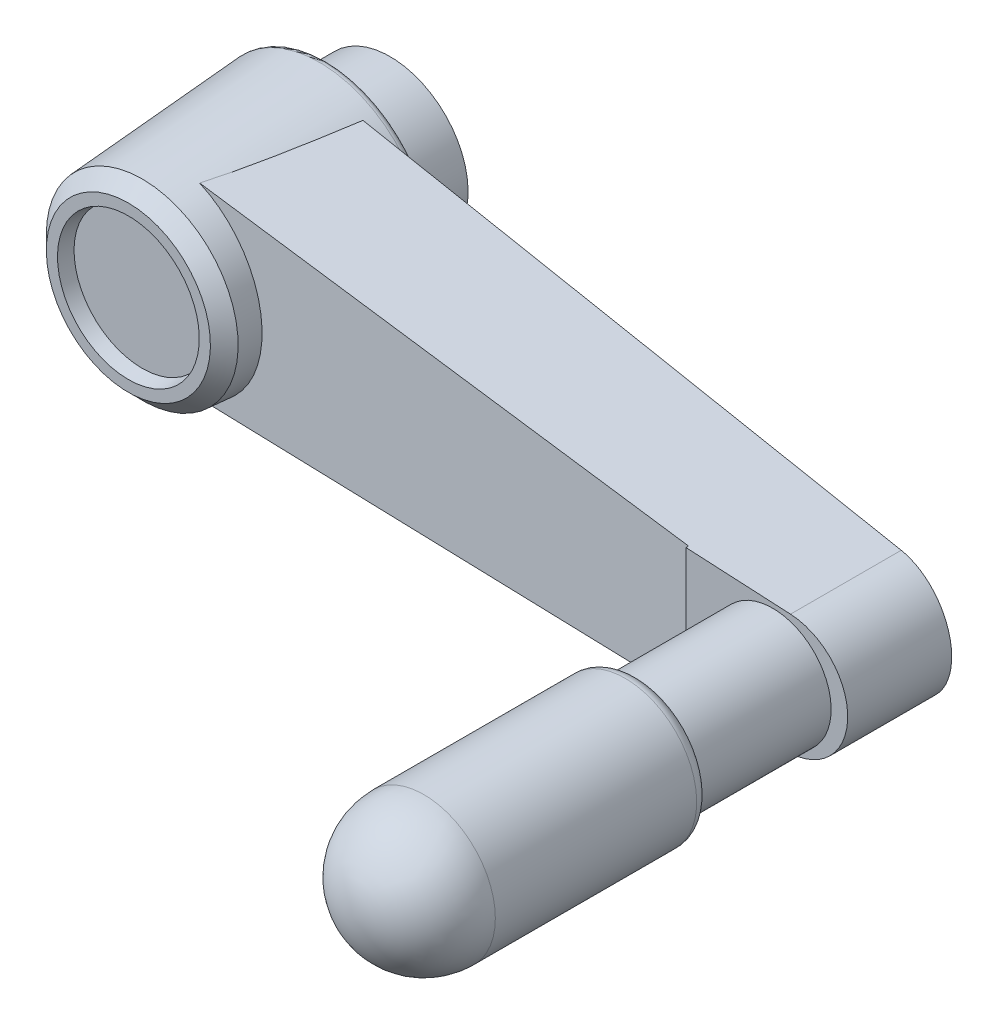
ISO-10303-21;
HEADER;
FILE_DESCRIPTION(('STEP AP214'),'2;1');
FILE_NAME('part.step','',(''),(''),'','','');
FILE_SCHEMA(('AUTOMOTIVE_DESIGN { 1 0 10303 214 1 1 1 1 }'));
ENDSEC;
DATA;
#1=APPLICATION_CONTEXT('core data for automotive mechanical design processes');
#2=APPLICATION_PROTOCOL_DEFINITION('international standard','automotive_design',2000,#1);
#3=PRODUCT_CONTEXT('',#1,'mechanical');
#4=PRODUCT('Part','Part','',(#3));
#5=PRODUCT_RELATED_PRODUCT_CATEGORY('part','',(#4));
#6=PRODUCT_DEFINITION_FORMATION('','',#4);
#7=PRODUCT_DEFINITION_CONTEXT('part definition',#1,'design');
#8=PRODUCT_DEFINITION('design','',#6,#7);
#9=PRODUCT_DEFINITION_SHAPE('','',#8);
#10=(LENGTH_UNIT() NAMED_UNIT(*) SI_UNIT(.MILLI.,.METRE.));
#11=(NAMED_UNIT(*) PLANE_ANGLE_UNIT() SI_UNIT($,.RADIAN.));
#12=(NAMED_UNIT(*) SI_UNIT($,.STERADIAN.) SOLID_ANGLE_UNIT());
#13=UNCERTAINTY_MEASURE_WITH_UNIT(LENGTH_MEASURE(1.E-05),#10,'distance_accuracy_value','');
#14=(GEOMETRIC_REPRESENTATION_CONTEXT(3) GLOBAL_UNCERTAINTY_ASSIGNED_CONTEXT((#13)) GLOBAL_UNIT_ASSIGNED_CONTEXT((#10,
#11,#12)) REPRESENTATION_CONTEXT('',''));
#15=CARTESIAN_POINT('',(0.,0.,0.));
#16=DIRECTION('',(0.,0.,1.));
#17=DIRECTION('',(1.,0.,0.));
#18=AXIS2_PLACEMENT_3D('',#15,#16,#17);
#19=CARTESIAN_POINT('',(0.,0.,24.0000000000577));
#20=DIRECTION('',(0.,0.,-1.));
#21=DIRECTION('',(0.,1.,0.));
#22=AXIS2_PLACEMENT_3D('',#19,#20,#21);
#23=CONICAL_SURFACE('',#22,5.99999999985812,1.04719755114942);
#24=CARTESIAN_POINT('',(2.55795384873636E-10,0.,27.4641016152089));
#25=VERTEX_POINT('',#24);
#26=VERTEX_LOOP('',#25);
#27=FACE_BOUND('',#26,.T.);
#28=CARTESIAN_POINT('',(0.,0.,24.));
#29=DIRECTION('',(0.,0.,-1.));
#30=DIRECTION('',(0.,1.,0.));
#31=AXIS2_PLACEMENT_3D('',#28,#29,#30);
#32=CIRCLE('',#31,6.);
#33=CARTESIAN_POINT('',(0.,6.,24.));
#34=VERTEX_POINT('',#33);
#35=EDGE_CURVE('E296',#34,#34,#32,.T.);
#36=ORIENTED_EDGE('',*,*,#35,.T.);
#37=EDGE_LOOP('',(#36));
#38=FACE_BOUND('',#37,.T.);
#39=ADVANCED_FACE('F15',(#27,#38),#23,.F.);
#40=CARTESIAN_POINT('',(0.,0.,12.41875));
#41=DIRECTION('',(0.,0.,-1.));
#42=DIRECTION('',(0.,1.,0.));
#43=AXIS2_PLACEMENT_3D('',#40,#41,#42);
#44=CYLINDRICAL_SURFACE('',#43,6.);
#45=CARTESIAN_POINT('',(0.,0.,0.837499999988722));
#46=DIRECTION('',(0.,0.,-1.));
#47=DIRECTION('',(1.,0.,0.));
#48=AXIS2_PLACEMENT_3D('',#45,#46,#47);
#49=CIRCLE('',#48,6.00000000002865);
#50=CARTESIAN_POINT('',(6.00000000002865,0.,0.837499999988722));
#51=VERTEX_POINT('',#50);
#52=EDGE_CURVE('E287',#51,#51,#49,.T.);
#53=ORIENTED_EDGE('',*,*,#52,.T.);
#54=EDGE_LOOP('',(#53));
#55=FACE_BOUND('',#54,.T.);
#56=ORIENTED_EDGE('',*,*,#35,.F.);
#57=EDGE_LOOP('',(#56));
#58=FACE_BOUND('',#57,.T.);
#59=ADVANCED_FACE('F397',(#55,#58),#44,.F.);
#60=CARTESIAN_POINT('',(0.,0.,0.));
#61=DIRECTION('',(0.,0.,-1.));
#62=DIRECTION('',(0.,1.,0.));
#63=AXIS2_PLACEMENT_3D('',#60,#61,#62);
#64=CONICAL_SURFACE('',#63,6.83750000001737,0.785398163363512);
#65=CARTESIAN_POINT('',(0.,0.,0.));
#66=DIRECTION('',(0.,0.,-1.));
#67=DIRECTION('',(0.,1.,0.));
#68=AXIS2_PLACEMENT_3D('',#65,#66,#67);
#69=CIRCLE('',#68,6.83750000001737);
#70=CARTESIAN_POINT('',(0.,6.83750000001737,0.));
#71=VERTEX_POINT('',#70);
#72=EDGE_CURVE('E284',#71,#71,#69,.F.);
#73=ORIENTED_EDGE('',*,*,#72,.F.);
#74=EDGE_LOOP('',(#73));
#75=FACE_BOUND('',#74,.T.);
#76=ORIENTED_EDGE('',*,*,#52,.F.);
#77=EDGE_LOOP('',(#76));
#78=FACE_BOUND('',#77,.T.);
#79=ADVANCED_FACE('F402',(#75,#78),#64,.F.);
#80=CARTESIAN_POINT('',(-4.5,0.,0.));
#81=DIRECTION('',(0.,0.,-1.));
#82=DIRECTION('',(0.,1.,0.));
#83=AXIS2_PLACEMENT_3D('',#80,#81,#82);
#84=PLANE('',#83);
#85=CARTESIAN_POINT('',(0.,0.,0.));
#86=DIRECTION('',(0.,0.,1.));
#87=DIRECTION('',(0.,-1.,0.));
#88=AXIS2_PLACEMENT_3D('',#85,#86,#87);
#89=CIRCLE('',#88,9.);
#90=CARTESIAN_POINT('',(0.,-9.,0.));
#91=VERTEX_POINT('',#90);
#92=EDGE_CURVE('E281',#91,#91,#89,.T.);
#93=ORIENTED_EDGE('',*,*,#92,.F.);
#94=EDGE_LOOP('',(#93));
#95=FACE_BOUND('',#94,.T.);
#96=ORIENTED_EDGE('',*,*,#72,.T.);
#97=EDGE_LOOP('',(#96));
#98=FACE_BOUND('',#97,.T.);
#99=ADVANCED_FACE('F518',(#95,#98),#84,.T.);
#100=CARTESIAN_POINT('',(0.,0.,0.1));
#101=DIRECTION('',(0.,0.,1.));
#102=DIRECTION('',(0.,-1.,0.));
#103=AXIS2_PLACEMENT_3D('',#100,#101,#102);
#104=CYLINDRICAL_SURFACE('',#103,9.);
#105=ORIENTED_EDGE('',*,*,#92,.T.);
#106=EDGE_LOOP('',(#105));
#107=FACE_BOUND('',#106,.T.);
#108=CARTESIAN_POINT('',(0.,0.,0.200000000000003));
#109=DIRECTION('',(0.,0.,1.));
#110=DIRECTION('',(0.,-1.,0.));
#111=AXIS2_PLACEMENT_3D('',#108,#109,#110);
#112=CIRCLE('',#111,9.);
#113=CARTESIAN_POINT('',(0.,-9.,0.200000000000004));
#114=VERTEX_POINT('',#113);
#115=EDGE_CURVE('E278',#114,#114,#112,.T.);
#116=ORIENTED_EDGE('',*,*,#115,.F.);
#117=EDGE_LOOP('',(#116));
#118=FACE_BOUND('',#117,.T.);
#119=ADVANCED_FACE('F514',(#107,#118),#104,.T.);
#120=CARTESIAN_POINT('',(-10.5,0.,0.2));
#121=DIRECTION('',(0.,0.,-1.));
#122=DIRECTION('',(1.,0.,0.));
#123=AXIS2_PLACEMENT_3D('',#120,#121,#122);
#124=PLANE('',#123);
#125=CARTESIAN_POINT('',(0.,0.,0.2));
#126=DIRECTION('',(0.,0.,1.));
#127=DIRECTION('',(0.,-1.,0.));
#128=AXIS2_PLACEMENT_3D('',#125,#126,#127);
#129=CIRCLE('',#128,12.);
#130=CARTESIAN_POINT('',(0.,-12.,0.200000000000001));
#131=VERTEX_POINT('',#130);
#132=EDGE_CURVE('E271',#131,#131,#129,.T.);
#133=ORIENTED_EDGE('',*,*,#132,.F.);
#134=EDGE_LOOP('',(#133));
#135=FACE_BOUND('',#134,.T.);
#136=ORIENTED_EDGE('',*,*,#115,.T.);
#137=EDGE_LOOP('',(#136));
#138=FACE_BOUND('',#137,.T.);
#139=ADVANCED_FACE('F509',(#135,#138),#124,.T.);
#140=CARTESIAN_POINT('',(-5.25,0.,38.365));
#141=DIRECTION('',(0.,0.,1.));
#142=DIRECTION('',(0.,-1.,0.));
#143=AXIS2_PLACEMENT_3D('',#140,#141,#142);
#144=PLANE('',#143);
#145=CARTESIAN_POINT('',(0.,0.,38.365));
#146=DIRECTION('',(0.,0.,1.));
#147=DIRECTION('',(0.,-1.,0.));
#148=AXIS2_PLACEMENT_3D('',#145,#146,#147);
#149=CIRCLE('',#148,10.5);
#150=CARTESIAN_POINT('',(0.,-10.5,38.365));
#151=VERTEX_POINT('',#150);
#152=EDGE_CURVE('E263',#151,#151,#149,.T.);
#153=ORIENTED_EDGE('',*,*,#152,.T.);
#154=EDGE_LOOP('',(#153));
#155=FACE_BOUND('',#154,.T.);
#156=ADVANCED_FACE('F242',(#155),#144,.T.);
#157=CARTESIAN_POINT('',(0.,0.,5.1));
#158=DIRECTION('',(0.,0.,1.));
#159=DIRECTION('',(0.,-1.,0.));
#160=AXIS2_PLACEMENT_3D('',#157,#158,#159);
#161=CYLINDRICAL_SURFACE('',#160,12.);
#162=ORIENTED_EDGE('',*,*,#132,.T.);
#163=EDGE_LOOP('',(#162));
#164=FACE_BOUND('',#163,.T.);
#165=CARTESIAN_POINT('',(0.,0.,10.));
#166=DIRECTION('',(0.,0.,1.));
#167=DIRECTION('',(0.,-1.,0.));
#168=AXIS2_PLACEMENT_3D('',#165,#166,#167);
#169=CIRCLE('',#168,12.);
#170=CARTESIAN_POINT('',(0.,-12.,10.));
#171=VERTEX_POINT('',#170);
#172=EDGE_CURVE('E266',#171,#171,#169,.T.);
#173=ORIENTED_EDGE('',*,*,#172,.F.);
#174=EDGE_LOOP('',(#173));
#175=FACE_BOUND('',#174,.T.);
#176=ADVANCED_FACE('F501',(#164,#175),#161,.T.);
#177=CARTESIAN_POINT('',(0.,0.,40.5));
#178=DIRECTION('',(0.,0.,1.));
#179=DIRECTION('',(0.,-1.,0.));
#180=AXIS2_PLACEMENT_3D('',#177,#178,#179);
#181=CONICAL_SURFACE('',#180,10.915001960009,0.191986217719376);
#182=CARTESIAN_POINT('',(0.,0.,40.5));
#183=DIRECTION('',(0.,0.,1.));
#184=DIRECTION('',(0.,-1.,0.));
#185=AXIS2_PLACEMENT_3D('',#182,#183,#184);
#186=CIRCLE('',#185,10.915001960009);
#187=CARTESIAN_POINT('',(0.,-10.915001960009,40.5));
#188=VERTEX_POINT('',#187);
#189=EDGE_CURVE('E217',#188,#188,#186,.F.);
#190=ORIENTED_EDGE('',*,*,#189,.F.);
#191=EDGE_LOOP('',(#190));
#192=FACE_BOUND('',#191,.T.);
#193=ORIENTED_EDGE('',*,*,#152,.F.);
#194=EDGE_LOOP('',(#193));
#195=FACE_BOUND('',#194,.T.);
#196=ADVANCED_FACE('F240',(#192,#195),#181,.F.);
#197=CARTESIAN_POINT('',(-13.8388156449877,0.,10.));
#198=DIRECTION('',(0.,0.,-1.));
#199=DIRECTION('',(0.,1.,0.));
#200=AXIS2_PLACEMENT_3D('',#197,#198,#199);
#201=PLANE('',#200);
#202=CARTESIAN_POINT('',(0.,0.,10.));
#203=DIRECTION('',(0.,0.,1.));
#204=DIRECTION('',(0.,-1.,0.));
#205=AXIS2_PLACEMENT_3D('',#202,#203,#204);
#206=CIRCLE('',#205,15.6776312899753);
#207=CARTESIAN_POINT('',(0.,-15.6776312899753,10.));
#208=VERTEX_POINT('',#207);
#209=CARTESIAN_POINT('',(0.,15.6776312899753,10.));
#210=VERTEX_POINT('',#209);
#211=EDGE_CURVE('E147',#208,#210,#206,.T.);
#212=ORIENTED_EDGE('',*,*,#211,.F.);
#213=CARTESIAN_POINT('',(0.,0.,10.));
#214=DIRECTION('',(0.,0.,1.));
#215=DIRECTION('',(-1.,0.,0.));
#216=AXIS2_PLACEMENT_3D('',#213,#214,#215);
#217=CIRCLE('',#216,15.6776312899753);
#218=CARTESIAN_POINT('',(-15.6776312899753,0.,10.));
#219=VERTEX_POINT('',#218);
#220=EDGE_CURVE('E259',#219,#208,#217,.T.);
#221=ORIENTED_EDGE('',*,*,#220,.F.);
#222=CARTESIAN_POINT('',(0.,0.,10.));
#223=DIRECTION('',(0.,0.,1.));
#224=DIRECTION('',(0.,1.,0.));
#225=AXIS2_PLACEMENT_3D('',#222,#223,#224);
#226=CIRCLE('',#225,15.6776312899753);
#227=EDGE_CURVE('E223',#210,#219,#226,.T.);
#228=ORIENTED_EDGE('',*,*,#227,.F.);
#229=EDGE_LOOP('',(#212,#221,#228));
#230=FACE_BOUND('',#229,.T.);
#231=ORIENTED_EDGE('',*,*,#172,.T.);
#232=EDGE_LOOP('',(#231));
#233=FACE_BOUND('',#232,.T.);
#234=ADVANCED_FACE('F229',(#230,#233),#201,.T.);
#235=CARTESIAN_POINT('',(-11.7732639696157,0.,40.5));
#236=DIRECTION('',(0.,0.,1.));
#237=DIRECTION('',(0.,-1.,0.));
#238=AXIS2_PLACEMENT_3D('',#235,#236,#237);
#239=PLANE('',#238);
#240=ORIENTED_EDGE('',*,*,#189,.T.);
#241=EDGE_LOOP('',(#240));
#242=FACE_BOUND('',#241,.T.);
#243=CARTESIAN_POINT('',(0.,0.,40.5));
#244=DIRECTION('',(0.,0.,-1.));
#245=DIRECTION('',(0.,1.,0.));
#246=AXIS2_PLACEMENT_3D('',#243,#244,#245);
#247=CIRCLE('',#246,12.6315259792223);
#248=CARTESIAN_POINT('',(0.,12.6315259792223,40.5));
#249=VERTEX_POINT('',#248);
#250=EDGE_CURVE('E197',#249,#249,#247,.T.);
#251=ORIENTED_EDGE('',*,*,#250,.F.);
#252=EDGE_LOOP('',(#251));
#253=FACE_BOUND('',#252,.T.);
#254=ADVANCED_FACE('F239',(#242,#253),#239,.T.);
#255=CARTESIAN_POINT('',(0.,0.,38.365));
#256=DIRECTION('',(0.,0.,-1.));
#257=DIRECTION('',(0.,1.,0.));
#258=AXIS2_PLACEMENT_3D('',#255,#256,#257);
#259=CONICAL_SURFACE('',#258,14.7665259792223,0.785398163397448);
#260=CARTESIAN_POINT('',(0.,0.,38.365));
#261=DIRECTION('',(0.,0.,-1.));
#262=DIRECTION('',(-1.,0.,0.));
#263=AXIS2_PLACEMENT_3D('',#260,#261,#262);
#264=CIRCLE('',#263,14.7665259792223);
#265=CARTESIAN_POINT('',(-14.7665259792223,0.,38.365));
#266=VERTEX_POINT('',#265);
#267=EDGE_CURVE('E177',#266,#266,#264,.T.);
#268=ORIENTED_EDGE('',*,*,#267,.F.);
#269=EDGE_LOOP('',(#268));
#270=FACE_BOUND('',#269,.T.);
#271=ORIENTED_EDGE('',*,*,#250,.T.);
#272=EDGE_LOOP('',(#271));
#273=FACE_BOUND('',#272,.T.);
#274=ADVANCED_FACE('F166',(#270,#273),#259,.T.);
#275=CARTESIAN_POINT('',(0.,0.,11.));
#276=DIRECTION('',(0.,0.,-1.));
#277=DIRECTION('',(0.,1.,0.));
#278=AXIS2_PLACEMENT_3D('',#275,#276,#277);
#279=TOROIDAL_SURFACE('',#278,15.6776312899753,1.);
#280=ORIENTED_EDGE('',*,*,#220,.T.);
#281=ORIENTED_EDGE('',*,*,#211,.T.);
#282=ORIENTED_EDGE('',*,*,#227,.T.);
#283=EDGE_LOOP('',(#280,#281,#282));
#284=FACE_BOUND('',#283,.T.);
#285=CARTESIAN_POINT('',(0.,0.,11.0697564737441));
#286=DIRECTION('',(0.,0.,-1.));
#287=DIRECTION('',(-1.,0.,0.));
#288=AXIS2_PLACEMENT_3D('',#285,#286,#287);
#289=CIRCLE('',#288,16.6751953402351);
#290=CARTESIAN_POINT('',(-16.6751953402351,0.,11.0697564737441));
#291=VERTEX_POINT('',#290);
#292=EDGE_CURVE('E175',#291,#291,#289,.F.);
#293=ORIENTED_EDGE('',*,*,#292,.F.);
#294=EDGE_LOOP('',(#293));
#295=FACE_BOUND('',#294,.T.);
#296=ADVANCED_FACE('F154',(#284,#295),#279,.T.);
#297=CARTESIAN_POINT('',(-16.65,-30.5,32.4));
#298=DIRECTION('',(0.0793605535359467,0.,-0.99684597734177));
#299=DIRECTION('',(0.99684597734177,0.,0.0793605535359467));
#300=AXIS2_PLACEMENT_3D('',#297,#298,#299);
#301=PLANE('',#300);
#302=CARTESIAN_POINT('',(-0.0840137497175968,0.,33.7188455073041));
#303=DIRECTION('',(0.0793605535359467,0.,-0.99684597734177));
#304=DIRECTION('',(-0.99684597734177,0.,-0.0793605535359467));
#305=AXIS2_PLACEMENT_3D('',#302,#303,#304);
#306=ELLIPSE('',#305,15.1391660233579,15.0911828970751);
#307=CARTESIAN_POINT('',(4.55339413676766,-14.3610207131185,34.0880371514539));
#308=VERTEX_POINT('',#307);
#309=CARTESIAN_POINT('',(4.55339413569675,14.3610207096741,34.088037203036));
#310=VERTEX_POINT('',#309);
#311=EDGE_CURVE('E181',#308,#310,#306,.F.);
#312=ORIENTED_EDGE('',*,*,#311,.F.);
#313=DIRECTION('',(-0.995510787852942,-0.0517400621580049,-0.0792542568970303));
#314=VECTOR('',#313,1.);
#315=CARTESIAN_POINT('',(86.35,-10.1097744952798,40.6));
#316=LINE('',#315,#314);
#317=CARTESIAN_POINT('',(86.35,-10.1097744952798,40.6));
#318=VERTEX_POINT('',#317);
#319=EDGE_CURVE('E203',#318,#308,#316,.T.);
#320=ORIENTED_EDGE('',*,*,#319,.F.);
#321=DIRECTION('',(0.,-1.,0.));
#322=VECTOR('',#321,1.);
#323=CARTESIAN_POINT('',(86.35,-30.5,40.6));
#324=LINE('',#323,#322);
#325=CARTESIAN_POINT('',(86.35,10.1097744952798,40.6));
#326=VERTEX_POINT('',#325);
#327=EDGE_CURVE('E191',#326,#318,#324,.T.);
#328=ORIENTED_EDGE('',*,*,#327,.F.);
#329=DIRECTION('',(0.995510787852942,-0.0517400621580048,0.0792542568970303));
#330=VECTOR('',#329,1.);
#331=CARTESIAN_POINT('',(4.55339412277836,14.3610207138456,34.0880372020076));
#332=LINE('',#331,#330);
#333=EDGE_CURVE('E185',#310,#326,#332,.T.);
#334=ORIENTED_EDGE('',*,*,#333,.F.);
#335=EDGE_LOOP('',(#312,#320,#328,#334));
#336=FACE_BOUND('',#335,.T.);
#337=ADVANCED_FACE('F165',(#336),#301,.F.);
#338=CARTESIAN_POINT('',(0.,0.,11.0697564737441));
#339=DIRECTION('',(0.,0.,-1.));
#340=DIRECTION('',(0.,1.,0.));
#341=AXIS2_PLACEMENT_3D('',#338,#339,#340);
#342=CONICAL_SURFACE('',#341,16.6751953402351,0.0698131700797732);
#343=ORIENTED_EDGE('',*,*,#292,.T.);
#344=EDGE_LOOP('',(#343));
#345=FACE_BOUND('',#344,.T.);
#346=CARTESIAN_POINT('',(-0.136149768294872,0.,11.9352168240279));
#347=DIRECTION('',(-0.116391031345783,0.,0.993203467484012));
#348=DIRECTION('',(-0.993203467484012,0.,-0.116391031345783));
#349=AXIS2_PLACEMENT_3D('',#346,#347,#348);
#350=ELLIPSE('',#349,16.7283713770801,16.6141186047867);
#351=CARTESIAN_POINT('',(8.56688792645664,14.1524258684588,12.9551041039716));
#352=VERTEX_POINT('',#351);
#353=CARTESIAN_POINT('',(8.56688793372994,-14.1524258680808,12.9551040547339));
#354=VERTEX_POINT('',#353);
#355=EDGE_CURVE('E291',#352,#354,#350,.F.);
#356=ORIENTED_EDGE('',*,*,#355,.T.);
#357=CARTESIAN_POINT('',(8.56688793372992,-14.1524258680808,12.955104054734));
#358=CARTESIAN_POINT('',(8.43577041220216,-14.159240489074,13.8424238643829));
#359=CARTESIAN_POINT('',(8.30222859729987,-14.166181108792,14.7293918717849));
#360=CARTESIAN_POINT('',(8.02927391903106,-14.180367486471,16.5024085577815));
#361=CARTESIAN_POINT('',(7.88986113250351,-14.1876132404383,17.3884572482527));
#362=CARTESIAN_POINT('',(7.60424431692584,-14.2024577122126,19.1587879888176));
#363=CARTESIAN_POINT('',(7.45804538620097,-14.2100561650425,20.0430708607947));
#364=CARTESIAN_POINT('',(7.15731726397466,-14.2256860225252,21.8102537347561));
#365=CARTESIAN_POINT('',(7.00278777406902,-14.2337174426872,22.6931536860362));
#366=CARTESIAN_POINT('',(6.68339244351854,-14.2503174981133,24.4573460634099));
#367=CARTESIAN_POINT('',(6.51852363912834,-14.2588862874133,25.3386379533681));
#368=CARTESIAN_POINT('',(6.17570137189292,-14.2767039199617,27.0986081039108));
#369=CARTESIAN_POINT('',(5.9977491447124,-14.2859526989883,27.9772866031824));
#370=CARTESIAN_POINT('',(5.71762610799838,-14.3005116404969,29.2928378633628));
#371=CARTESIAN_POINT('',(5.62201355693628,-14.305480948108,29.7311109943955));
#372=CARTESIAN_POINT('',(5.42557931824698,-14.3156902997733,30.606474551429));
#373=CARTESIAN_POINT('',(5.32475778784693,-14.3209303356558,31.043565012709));
#374=CARTESIAN_POINT('',(5.11686483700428,-14.3317352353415,31.9164075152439));
#375=CARTESIAN_POINT('',(5.00979148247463,-14.3373001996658,32.3521590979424));
#376=CARTESIAN_POINT('',(4.78783891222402,-14.3488358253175,33.2217072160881));
#377=CARTESIAN_POINT('',(4.67295889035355,-14.3548065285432,33.6555035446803));
#378=CARTESIAN_POINT('',(4.55339415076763,-14.3610207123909,34.0880371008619));
#379=B_SPLINE_CURVE_WITH_KNOTS('',3,(#357,#358,#359,#360,#361,#362,#363,#364,#365,#366,#367,
#368,#369,#370,#371,#372,#373,#374,#375,#376,#377,#378),.UNSPECIFIED.,.F.,.F.,(4,2,2,2,2,2,2,2,
2,2,4),(0.,2.69095021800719,5.38186522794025,8.07079032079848,10.7598117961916,13.4496076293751,
16.1391497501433,17.4849504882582,18.8307106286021,20.1768893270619,21.5232072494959),.UNSPECIFIED.);
#380=EDGE_CURVE('E421',#354,#308,#379,.T.);
#381=ORIENTED_EDGE('',*,*,#380,.T.);
#382=ORIENTED_EDGE('',*,*,#311,.T.);
#383=CARTESIAN_POINT('',(4.55339412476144,14.3610207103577,34.0880371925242));
#384=CARTESIAN_POINT('',(4.6729588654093,14.354806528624,33.6555036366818));
#385=CARTESIAN_POINT('',(4.78783888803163,14.3488358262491,33.2217073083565));
#386=CARTESIAN_POINT('',(5.00979145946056,14.3373002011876,32.3521591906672));
#387=CARTESIAN_POINT('',(5.11686481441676,14.3317352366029,31.9164076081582));
#388=CARTESIAN_POINT('',(5.32475776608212,14.3209303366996,31.0435651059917));
#389=CARTESIAN_POINT('',(5.42557929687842,14.3156903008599,30.6064746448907));
#390=CARTESIAN_POINT('',(5.62201353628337,14.3054809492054,29.7311110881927));
#391=CARTESIAN_POINT('',(5.71762608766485,14.300511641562,29.2928379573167));
#392=CARTESIAN_POINT('',(5.99774912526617,14.2859526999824,27.9772866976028));
#393=CARTESIAN_POINT('',(6.17570135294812,14.2767039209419,27.0986081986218));
#394=CARTESIAN_POINT('',(6.51852362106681,14.2588862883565,25.3386380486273));
#395=CARTESIAN_POINT('',(6.68339242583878,14.2503174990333,24.4573461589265));
#396=CARTESIAN_POINT('',(7.00278775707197,14.2337174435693,22.693153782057));
#397=CARTESIAN_POINT('',(7.15731724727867,14.2256860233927,21.8102538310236));
#398=CARTESIAN_POINT('',(7.45804537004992,14.2100561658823,20.0430709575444));
#399=CARTESIAN_POINT('',(7.60424430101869,14.2024577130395,19.1587880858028));
#400=CARTESIAN_POINT('',(7.88986111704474,14.1876132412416,17.3884573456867));
#401=CARTESIAN_POINT('',(8.02927390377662,14.1803674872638,16.5024086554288));
#402=CARTESIAN_POINT('',(8.30222858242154,14.1661811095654,14.7293919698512));
#403=CARTESIAN_POINT('',(8.4357703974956,14.1592404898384,13.8424239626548));
#404=CARTESIAN_POINT('',(8.56688791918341,14.1524258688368,12.9551041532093));
#405=B_SPLINE_CURVE_WITH_KNOTS('',3,(#383,#384,#385,#386,#387,#388,#389,#390,#391,#392,#393,
#394,#395,#396,#397,#398,#399,#400,#401,#402,#403,#404),.UNSPECIFIED.,.F.,.F.,(4,2,2,2,2,2,2,2,
2,2,4),(0.,1.34631792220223,2.69249662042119,4.03825676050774,5.38405749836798,8.07359961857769,
10.763395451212,13.4524169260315,16.141342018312,18.8322570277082,21.523207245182),.UNSPECIFIED.);
#406=EDGE_CURVE('E37',#310,#352,#405,.T.);
#407=ORIENTED_EDGE('',*,*,#406,.T.);
#408=EDGE_LOOP('',(#356,#381,#382,#407));
#409=FACE_BOUND('',#408,.T.);
#410=ORIENTED_EDGE('',*,*,#267,.T.);
#411=EDGE_LOOP('',(#410));
#412=FACE_BOUND('',#411,.T.);
#413=ADVANCED_FACE('F440',(#345,#409,#412),#342,.T.);
#414=CARTESIAN_POINT('',(0.756646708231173,-14.5583505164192,71.));
#415=DIRECTION('',(0.0519033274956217,-0.99865211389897,0.));
#416=DIRECTION('',(0.99865211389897,0.0519033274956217,0.));
#417=AXIS2_PLACEMENT_3D('',#414,#415,#416);
#418=PLANE('',#417);
#419=DIRECTION('',(-1.42108547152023E-13,0.,1.));
#420=VECTOR('',#419,1.);
#421=CARTESIAN_POINT('',(86.35,-10.1097744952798,40.6));
#422=LINE('',#421,#420);
#423=CARTESIAN_POINT('',(86.35,-10.1097744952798,41.));
#424=VERTEX_POINT('',#423);
#425=EDGE_CURVE('E212',#424,#318,#422,.F.);
#426=ORIENTED_EDGE('',*,*,#425,.T.);
#427=ORIENTED_EDGE('',*,*,#319,.T.);
#428=ORIENTED_EDGE('',*,*,#380,.F.);
#429=DIRECTION('',(0.991882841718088,0.0515515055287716,0.116236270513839));
#430=VECTOR('',#429,1.);
#431=CARTESIAN_POINT('',(8.56688793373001,-14.1524258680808,12.9551040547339));
#432=LINE('',#431,#430);
#433=CARTESIAN_POINT('',(102.446245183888,-9.27319820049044,23.9565912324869));
#434=VERTEX_POINT('',#433);
#435=EDGE_CURVE('E417',#354,#434,#432,.T.);
#436=ORIENTED_EDGE('',*,*,#435,.T.);
#437=DIRECTION('',(0.,0.,1.));
#438=VECTOR('',#437,1.);
#439=CARTESIAN_POINT('',(102.446245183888,-9.27319820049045,71.));
#440=LINE('',#439,#438);
#441=CARTESIAN_POINT('',(102.446245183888,-9.27319820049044,41.));
#442=VERTEX_POINT('',#441);
#443=EDGE_CURVE('E463',#442,#434,#440,.F.);
#444=ORIENTED_EDGE('',*,*,#443,.F.);
#445=DIRECTION('',(0.99865211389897,0.0519033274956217,0.));
#446=VECTOR('',#445,1.);
#447=CARTESIAN_POINT('',(0.756646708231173,-14.5583505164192,41.));
#448=LINE('',#447,#446);
#449=EDGE_CURVE('E200',#442,#424,#448,.F.);
#450=ORIENTED_EDGE('',*,*,#449,.T.);
#451=EDGE_LOOP('',(#426,#427,#428,#436,#444,#450));
#452=FACE_BOUND('',#451,.T.);
#453=ADVANCED_FACE('F436',(#452),#418,.T.);
#454=CARTESIAN_POINT('',(86.35,-30.5,40.6));
#455=DIRECTION('',(1.,0.,1.42108547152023E-13));
#456=DIRECTION('',(-1.42108547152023E-13,0.,1.));
#457=AXIS2_PLACEMENT_3D('',#454,#455,#456);
#458=PLANE('',#457);
#459=DIRECTION('',(0.,1.,0.));
#460=VECTOR('',#459,1.);
#461=CARTESIAN_POINT('',(86.35,-30.5,41.));
#462=LINE('',#461,#460);
#463=CARTESIAN_POINT('',(86.35,10.1097744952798,41.));
#464=VERTEX_POINT('',#463);
#465=EDGE_CURVE('E188',#424,#464,#462,.T.);
#466=ORIENTED_EDGE('',*,*,#465,.T.);
#467=DIRECTION('',(-1.42108547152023E-13,0.,1.));
#468=VECTOR('',#467,1.);
#469=CARTESIAN_POINT('',(86.35,10.1097744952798,40.6));
#470=LINE('',#469,#468);
#471=EDGE_CURVE('E209',#326,#464,#470,.T.);
#472=ORIENTED_EDGE('',*,*,#471,.F.);
#473=ORIENTED_EDGE('',*,*,#327,.T.);
#474=ORIENTED_EDGE('',*,*,#425,.F.);
#475=EDGE_LOOP('',(#466,#472,#473,#474));
#476=FACE_BOUND('',#475,.T.);
#477=ADVANCED_FACE('F451',(#476),#458,.F.);
#478=CARTESIAN_POINT('',(102.446245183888,9.27319820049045,71.));
#479=DIRECTION('',(0.0519033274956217,0.99865211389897,0.));
#480=DIRECTION('',(-0.99865211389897,0.0519033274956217,0.));
#481=AXIS2_PLACEMENT_3D('',#478,#479,#480);
#482=PLANE('',#481);
#483=DIRECTION('',(0.,0.,1.));
#484=VECTOR('',#483,1.);
#485=CARTESIAN_POINT('',(102.446245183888,9.27319820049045,71.));
#486=LINE('',#485,#484);
#487=CARTESIAN_POINT('',(102.446245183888,9.27319820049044,41.));
#488=VERTEX_POINT('',#487);
#489=CARTESIAN_POINT('',(102.446245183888,9.27319820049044,23.9565912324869));
#490=VERTEX_POINT('',#489);
#491=EDGE_CURVE('E184',#488,#490,#486,.F.);
#492=ORIENTED_EDGE('',*,*,#491,.T.);
#493=DIRECTION('',(-0.991882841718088,0.0515515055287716,-0.116236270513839));
#494=VECTOR('',#493,1.);
#495=CARTESIAN_POINT('',(102.446245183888,9.27319820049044,23.9565912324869));
#496=LINE('',#495,#494);
#497=EDGE_CURVE('E413',#490,#352,#496,.T.);
#498=ORIENTED_EDGE('',*,*,#497,.T.);
#499=ORIENTED_EDGE('',*,*,#406,.F.);
#500=ORIENTED_EDGE('',*,*,#333,.T.);
#501=ORIENTED_EDGE('',*,*,#471,.T.);
#502=DIRECTION('',(-0.99865211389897,0.0519033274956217,0.));
#503=VECTOR('',#502,1.);
#504=CARTESIAN_POINT('',(102.446245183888,9.27319820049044,41.));
#505=LINE('',#504,#503);
#506=EDGE_CURVE('E182',#464,#488,#505,.F.);
#507=ORIENTED_EDGE('',*,*,#506,.T.);
#508=EDGE_LOOP('',(#492,#498,#499,#500,#501,#507));
#509=FACE_BOUND('',#508,.T.);
#510=ADVANCED_FACE('F446',(#509),#482,.T.);
#511=CARTESIAN_POINT('',(101.964285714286,0.,71.));
#512=DIRECTION('',(0.,0.,1.));
#513=DIRECTION('',(0.,-1.,0.));
#514=AXIS2_PLACEMENT_3D('',#511,#512,#513);
#515=CYLINDRICAL_SURFACE('',#514,9.28571428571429);
#516=CARTESIAN_POINT('',(101.964285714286,0.,23.9001116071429));
#517=DIRECTION('',(-0.116391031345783,0.,0.993203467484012));
#518=DIRECTION('',(0.993203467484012,0.,0.116391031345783));
#519=AXIS2_PLACEMENT_3D('',#516,#517,#518);
#520=ELLIPSE('',#519,9.34925681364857,9.28571428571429);
#521=EDGE_CURVE('E414',#434,#490,#520,.T.);
#522=ORIENTED_EDGE('',*,*,#521,.T.);
#523=ORIENTED_EDGE('',*,*,#491,.F.);
#524=CARTESIAN_POINT('',(101.964285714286,0.,41.));
#525=DIRECTION('',(0.,0.,1.));
#526=DIRECTION('',(0.,-1.,0.));
#527=AXIS2_PLACEMENT_3D('',#524,#525,#526);
#528=CIRCLE('',#527,9.28571428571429);
#529=EDGE_CURVE('E484',#488,#442,#528,.F.);
#530=ORIENTED_EDGE('',*,*,#529,.T.);
#531=ORIENTED_EDGE('',*,*,#443,.T.);
#532=EDGE_LOOP('',(#522,#523,#530,#531));
#533=FACE_BOUND('',#532,.T.);
#534=ADVANCED_FACE('F450',(#533),#515,.T.);
#535=CARTESIAN_POINT('',(86.35,-30.5,41.));
#536=DIRECTION('',(0.,0.,-1.));
#537=DIRECTION('',(0.,1.,0.));
#538=AXIS2_PLACEMENT_3D('',#535,#536,#537);
#539=PLANE('',#538);
#540=CARTESIAN_POINT('',(100.,0.,41.));
#541=DIRECTION('',(0.,0.,-1.));
#542=DIRECTION('',(0.,1.,0.));
#543=AXIS2_PLACEMENT_3D('',#540,#541,#542);
#544=CIRCLE('',#543,6.75);
#545=CARTESIAN_POINT('',(100.,6.75,41.));
#546=VERTEX_POINT('',#545);
#547=EDGE_CURVE('E9',#546,#546,#544,.T.);
#548=ORIENTED_EDGE('',*,*,#547,.T.);
#549=EDGE_LOOP('',(#548));
#550=FACE_BOUND('',#549,.T.);
#551=ORIENTED_EDGE('',*,*,#529,.F.);
#552=ORIENTED_EDGE('',*,*,#506,.F.);
#553=ORIENTED_EDGE('',*,*,#465,.F.);
#554=ORIENTED_EDGE('',*,*,#449,.F.);
#555=EDGE_LOOP('',(#551,#552,#553,#554));
#556=FACE_BOUND('',#555,.T.);
#557=ADVANCED_FACE('F168',(#550,#556),#539,.F.);
#558=CARTESIAN_POINT('',(111.35,-30.5,25.));
#559=DIRECTION('',(-0.116391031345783,0.,0.993203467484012));
#560=DIRECTION('',(-0.993203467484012,0.,-0.116391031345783));
#561=AXIS2_PLACEMENT_3D('',#558,#559,#560);
#562=PLANE('',#561);
#563=ORIENTED_EDGE('',*,*,#355,.F.);
#564=ORIENTED_EDGE('',*,*,#497,.F.);
#565=ORIENTED_EDGE('',*,*,#521,.F.);
#566=ORIENTED_EDGE('',*,*,#435,.F.);
#567=EDGE_LOOP('',(#563,#564,#565,#566));
#568=FACE_BOUND('',#567,.T.);
#569=CARTESIAN_POINT('',(100.,0.,23.669921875));
#570=DIRECTION('',(-0.116391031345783,0.,0.993203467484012));
#571=DIRECTION('',(-0.993203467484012,0.,-0.116391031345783));
#572=AXIS2_PLACEMENT_3D('',#569,#570,#571);
#573=ELLIPSE('',#572,3.34624284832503,3.3235);
#574=CARTESIAN_POINT('',(96.6765,0.,23.28044921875));
#575=VERTEX_POINT('',#574);
#576=EDGE_CURVE('E180',#575,#575,#573,.F.);
#577=ORIENTED_EDGE('',*,*,#576,.F.);
#578=EDGE_LOOP('',(#577));
#579=FACE_BOUND('',#578,.T.);
#580=ADVANCED_FACE('F445',(#568,#579),#562,.F.);
#581=CARTESIAN_POINT('',(100.,0.,31.66175));
#582=DIRECTION('',(0.,0.,-1.));
#583=DIRECTION('',(0.,1.,0.));
#584=AXIS2_PLACEMENT_3D('',#581,#582,#583);
#585=CYLINDRICAL_SURFACE('',#584,3.3235);
#586=ORIENTED_EDGE('',*,*,#576,.T.);
#587=EDGE_LOOP('',(#586));
#588=FACE_BOUND('',#587,.T.);
#589=CARTESIAN_POINT('',(100.,0.,26.0904999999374));
#590=DIRECTION('',(0.,0.,1.));
#591=DIRECTION('',(1.,0.,0.));
#592=AXIS2_PLACEMENT_3D('',#589,#590,#591);
#593=CIRCLE('',#592,3.3235);
#594=CARTESIAN_POINT('',(103.3235,0.,26.0904999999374));
#595=VERTEX_POINT('',#594);
#596=EDGE_CURVE('E28',#595,#595,#593,.T.);
#597=ORIENTED_EDGE('',*,*,#596,.T.);
#598=EDGE_LOOP('',(#597));
#599=FACE_BOUND('',#598,.T.);
#600=ADVANCED_FACE('F393',(#588,#599),#585,.F.);
#601=CARTESIAN_POINT('',(100.,0.,30.));
#602=DIRECTION('',(0.,0.,1.));
#603=DIRECTION('',(0.,-1.,0.));
#604=AXIS2_PLACEMENT_3D('',#601,#602,#603);
#605=PLANE('',#604);
#606=DIRECTION('',(-0.866025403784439,0.5,0.));
#607=VECTOR('',#606,1.);
#608=CARTESIAN_POINT('',(100.,2.3094010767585,30.));
#609=LINE('',#608,#607);
#610=CARTESIAN_POINT('',(100.,2.30940107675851,30.));
#611=VERTEX_POINT('',#610);
#612=CARTESIAN_POINT('',(102.,1.15470053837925,30.));
#613=VERTEX_POINT('',#612);
#614=EDGE_CURVE('E354',#611,#613,#609,.F.);
#615=ORIENTED_EDGE('',*,*,#614,.T.);
#616=DIRECTION('',(0.,1.,0.));
#617=VECTOR('',#616,1.);
#618=CARTESIAN_POINT('',(102.,1.15470053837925,30.));
#619=LINE('',#618,#617);
#620=CARTESIAN_POINT('',(102.,-1.15470053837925,30.));
#621=VERTEX_POINT('',#620);
#622=EDGE_CURVE('E359',#613,#621,#619,.F.);
#623=ORIENTED_EDGE('',*,*,#622,.T.);
#624=DIRECTION('',(0.866025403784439,0.5,0.));
#625=VECTOR('',#624,1.);
#626=CARTESIAN_POINT('',(102.,-1.15470053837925,30.));
#627=LINE('',#626,#625);
#628=CARTESIAN_POINT('',(100.,-2.3094010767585,30.));
#629=VERTEX_POINT('',#628);
#630=EDGE_CURVE('E364',#621,#629,#627,.F.);
#631=ORIENTED_EDGE('',*,*,#630,.T.);
#632=DIRECTION('',(0.866025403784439,-0.5,0.));
#633=VECTOR('',#632,1.);
#634=CARTESIAN_POINT('',(100.,-2.3094010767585,30.));
#635=LINE('',#634,#633);
#636=CARTESIAN_POINT('',(98.,-1.15470053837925,30.));
#637=VERTEX_POINT('',#636);
#638=EDGE_CURVE('E114',#629,#637,#635,.F.);
#639=ORIENTED_EDGE('',*,*,#638,.T.);
#640=DIRECTION('',(0.,-1.,0.));
#641=VECTOR('',#640,1.);
#642=CARTESIAN_POINT('',(98.,-1.15470053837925,30.));
#643=LINE('',#642,#641);
#644=CARTESIAN_POINT('',(98.,1.15470053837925,30.));
#645=VERTEX_POINT('',#644);
#646=EDGE_CURVE('E98',#637,#645,#643,.F.);
#647=ORIENTED_EDGE('',*,*,#646,.T.);
#648=DIRECTION('',(-0.866025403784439,-0.5,0.));
#649=VECTOR('',#648,1.);
#650=CARTESIAN_POINT('',(98.,1.15470053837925,30.));
#651=LINE('',#650,#649);
#652=EDGE_CURVE('E103',#645,#611,#651,.F.);
#653=ORIENTED_EDGE('',*,*,#652,.T.);
#654=EDGE_LOOP('',(#615,#623,#631,#639,#647,#653));
#655=FACE_BOUND('',#654,.T.);
#656=ADVANCED_FACE('F17',(#655),#605,.F.);
#657=CARTESIAN_POINT('',(102.,-1.15470053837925,26.));
#658=DIRECTION('',(0.5,-0.866025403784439,0.));
#659=DIRECTION('',(0.866025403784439,0.5,0.));
#660=AXIS2_PLACEMENT_3D('',#657,#658,#659);
#661=PLANE('',#660);
#662=DIRECTION('',(0.,0.,1.));
#663=VECTOR('',#662,1.);
#664=CARTESIAN_POINT('',(102.,-1.15470053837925,26.));
#665=LINE('',#664,#663);
#666=CARTESIAN_POINT('',(102.,-1.15470053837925,26.));
#667=VERTEX_POINT('',#666);
#668=EDGE_CURVE('E362',#621,#667,#665,.F.);
#669=ORIENTED_EDGE('',*,*,#668,.T.);
#670=DIRECTION('',(0.866025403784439,0.5,0.));
#671=VECTOR('',#670,1.);
#672=CARTESIAN_POINT('',(100.,-2.3094010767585,26.));
#673=LINE('',#672,#671);
#674=CARTESIAN_POINT('',(100.,-2.3094010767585,26.));
#675=VERTEX_POINT('',#674);
#676=EDGE_CURVE('E345',#675,#667,#673,.T.);
#677=ORIENTED_EDGE('',*,*,#676,.F.);
#678=DIRECTION('',(0.,0.,1.));
#679=VECTOR('',#678,1.);
#680=CARTESIAN_POINT('',(100.,-2.3094010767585,26.));
#681=LINE('',#680,#679);
#682=EDGE_CURVE('E366',#629,#675,#681,.F.);
#683=ORIENTED_EDGE('',*,*,#682,.F.);
#684=ORIENTED_EDGE('',*,*,#630,.F.);
#685=EDGE_LOOP('',(#669,#677,#683,#684));
#686=FACE_BOUND('',#685,.T.);
#687=ADVANCED_FACE('F384',(#686),#661,.F.);
#688=CARTESIAN_POINT('',(100.,-2.3094010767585,26.));
#689=DIRECTION('',(-0.5,-0.866025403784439,0.));
#690=DIRECTION('',(0.866025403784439,-0.5,0.));
#691=AXIS2_PLACEMENT_3D('',#688,#689,#690);
#692=PLANE('',#691);
#693=ORIENTED_EDGE('',*,*,#682,.T.);
#694=DIRECTION('',(0.866025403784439,-0.5,0.));
#695=VECTOR('',#694,1.);
#696=CARTESIAN_POINT('',(98.,-1.15470053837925,26.));
#697=LINE('',#696,#695);
#698=CARTESIAN_POINT('',(98.,-1.15470053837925,26.));
#699=VERTEX_POINT('',#698);
#700=EDGE_CURVE('E348',#699,#675,#697,.T.);
#701=ORIENTED_EDGE('',*,*,#700,.F.);
#702=DIRECTION('',(0.,0.,1.));
#703=VECTOR('',#702,1.);
#704=CARTESIAN_POINT('',(98.,-1.15470053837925,26.));
#705=LINE('',#704,#703);
#706=EDGE_CURVE('E116',#637,#699,#705,.F.);
#707=ORIENTED_EDGE('',*,*,#706,.F.);
#708=ORIENTED_EDGE('',*,*,#638,.F.);
#709=EDGE_LOOP('',(#693,#701,#707,#708));
#710=FACE_BOUND('',#709,.T.);
#711=ADVANCED_FACE('F370',(#710),#692,.F.);
#712=CARTESIAN_POINT('',(98.,-1.15470053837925,26.));
#713=DIRECTION('',(-1.,0.,0.));
#714=DIRECTION('',(0.,-1.,0.));
#715=AXIS2_PLACEMENT_3D('',#712,#713,#714);
#716=PLANE('',#715);
#717=ORIENTED_EDGE('',*,*,#706,.T.);
#718=DIRECTION('',(0.,1.,0.));
#719=VECTOR('',#718,1.);
#720=CARTESIAN_POINT('',(98.,1.6165,26.));
#721=LINE('',#720,#719);
#722=CARTESIAN_POINT('',(98.,1.15470053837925,26.));
#723=VERTEX_POINT('',#722);
#724=EDGE_CURVE('E120',#723,#699,#721,.F.);
#725=ORIENTED_EDGE('',*,*,#724,.F.);
#726=DIRECTION('',(0.,0.,1.));
#727=VECTOR('',#726,1.);
#728=CARTESIAN_POINT('',(98.,1.15470053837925,26.));
#729=LINE('',#728,#727);
#730=EDGE_CURVE('E105',#645,#723,#729,.F.);
#731=ORIENTED_EDGE('',*,*,#730,.F.);
#732=ORIENTED_EDGE('',*,*,#646,.F.);
#733=EDGE_LOOP('',(#717,#725,#731,#732));
#734=FACE_BOUND('',#733,.T.);
#735=ADVANCED_FACE('F118',(#734),#716,.F.);
#736=CARTESIAN_POINT('',(98.,1.15470053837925,26.));
#737=DIRECTION('',(-0.5,0.866025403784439,0.));
#738=DIRECTION('',(-0.866025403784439,-0.5,0.));
#739=AXIS2_PLACEMENT_3D('',#736,#737,#738);
#740=PLANE('',#739);
#741=ORIENTED_EDGE('',*,*,#730,.T.);
#742=DIRECTION('',(-0.866025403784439,-0.5,0.));
#743=VECTOR('',#742,1.);
#744=CARTESIAN_POINT('',(100.,2.3094010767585,26.));
#745=LINE('',#744,#743);
#746=CARTESIAN_POINT('',(100.,2.30940107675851,26.));
#747=VERTEX_POINT('',#746);
#748=EDGE_CURVE('E352',#747,#723,#745,.T.);
#749=ORIENTED_EDGE('',*,*,#748,.F.);
#750=DIRECTION('',(0.,0.,1.));
#751=VECTOR('',#750,1.);
#752=CARTESIAN_POINT('',(100.,2.3094010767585,26.));
#753=LINE('',#752,#751);
#754=EDGE_CURVE('E108',#747,#611,#753,.T.);
#755=ORIENTED_EDGE('',*,*,#754,.T.);
#756=ORIENTED_EDGE('',*,*,#652,.F.);
#757=EDGE_LOOP('',(#741,#749,#755,#756));
#758=FACE_BOUND('',#757,.T.);
#759=ADVANCED_FACE('F104',(#758),#740,.F.);
#760=CARTESIAN_POINT('',(100.,2.3094010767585,26.));
#761=DIRECTION('',(0.5,0.866025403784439,0.));
#762=DIRECTION('',(-0.866025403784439,0.5,0.));
#763=AXIS2_PLACEMENT_3D('',#760,#761,#762);
#764=PLANE('',#763);
#765=ORIENTED_EDGE('',*,*,#754,.F.);
#766=DIRECTION('',(-0.866025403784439,0.5,0.));
#767=VECTOR('',#766,1.);
#768=CARTESIAN_POINT('',(102.,1.15470053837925,26.));
#769=LINE('',#768,#767);
#770=CARTESIAN_POINT('',(102.,1.15470053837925,26.));
#771=VERTEX_POINT('',#770);
#772=EDGE_CURVE('E139',#771,#747,#769,.T.);
#773=ORIENTED_EDGE('',*,*,#772,.F.);
#774=DIRECTION('',(0.,0.,1.));
#775=VECTOR('',#774,1.);
#776=CARTESIAN_POINT('',(102.,1.15470053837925,26.));
#777=LINE('',#776,#775);
#778=EDGE_CURVE('E357',#613,#771,#777,.F.);
#779=ORIENTED_EDGE('',*,*,#778,.F.);
#780=ORIENTED_EDGE('',*,*,#614,.F.);
#781=EDGE_LOOP('',(#765,#773,#779,#780));
#782=FACE_BOUND('',#781,.T.);
#783=ADVANCED_FACE('F377',(#782),#764,.F.);
#784=CARTESIAN_POINT('',(102.,1.15470053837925,26.));
#785=DIRECTION('',(1.,0.,0.));
#786=DIRECTION('',(0.,1.,0.));
#787=AXIS2_PLACEMENT_3D('',#784,#785,#786);
#788=PLANE('',#787);
#789=ORIENTED_EDGE('',*,*,#778,.T.);
#790=DIRECTION('',(0.,1.,0.));
#791=VECTOR('',#790,1.);
#792=CARTESIAN_POINT('',(102.,1.6165,26.));
#793=LINE('',#792,#791);
#794=EDGE_CURVE('E342',#667,#771,#793,.T.);
#795=ORIENTED_EDGE('',*,*,#794,.F.);
#796=ORIENTED_EDGE('',*,*,#668,.F.);
#797=ORIENTED_EDGE('',*,*,#622,.F.);
#798=EDGE_LOOP('',(#789,#795,#796,#797));
#799=FACE_BOUND('',#798,.T.);
#800=ADVANCED_FACE('F382',(#799),#788,.F.);
#801=CARTESIAN_POINT('',(100.,1.6165,26.));
#802=DIRECTION('',(0.,0.,-1.));
#803=DIRECTION('',(0.,1.,0.));
#804=AXIS2_PLACEMENT_3D('',#801,#802,#803);
#805=PLANE('',#804);
#806=CARTESIAN_POINT('',(100.,0.,25.9999999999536));
#807=DIRECTION('',(0.,0.,1.));
#808=DIRECTION('',(-1.,0.,0.));
#809=AXIS2_PLACEMENT_3D('',#806,#807,#808);
#810=CIRCLE('',#809,3.23300000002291);
#811=CARTESIAN_POINT('',(96.7669999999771,0.,25.9999999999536));
#812=VERTEX_POINT('',#811);
#813=EDGE_CURVE('E136',#812,#812,#810,.T.);
#814=ORIENTED_EDGE('',*,*,#813,.F.);
#815=EDGE_LOOP('',(#814));
#816=FACE_BOUND('',#815,.T.);
#817=ORIENTED_EDGE('',*,*,#794,.T.);
#818=ORIENTED_EDGE('',*,*,#772,.T.);
#819=ORIENTED_EDGE('',*,*,#748,.T.);
#820=ORIENTED_EDGE('',*,*,#724,.T.);
#821=ORIENTED_EDGE('',*,*,#700,.T.);
#822=ORIENTED_EDGE('',*,*,#676,.T.);
#823=EDGE_LOOP('',(#817,#818,#819,#820,#821,#822));
#824=FACE_BOUND('',#823,.T.);
#825=ADVANCED_FACE('F374',(#816,#824),#805,.T.);
#826=CARTESIAN_POINT('',(100.,0.,26.7670000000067));
#827=DIRECTION('',(0.,0.,1.));
#828=DIRECTION('',(-1.,0.,0.));
#829=AXIS2_PLACEMENT_3D('',#826,#827,#828);
#830=CONICAL_SURFACE('',#829,4.0000000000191,0.785398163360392);
#831=ORIENTED_EDGE('',*,*,#813,.T.);
#832=EDGE_LOOP('',(#831));
#833=FACE_BOUND('',#832,.T.);
#834=ORIENTED_EDGE('',*,*,#596,.F.);
#835=EDGE_LOOP('',(#834));
#836=FACE_BOUND('',#835,.T.);
#837=ADVANCED_FACE('F321',(#833,#836),#830,.T.);
#838=CARTESIAN_POINT('',(100.,0.,95.));
#839=DIRECTION('',(0.,0.,1.));
#840=DIRECTION('',(0.,1.,0.));
#841=AXIS2_PLACEMENT_3D('',#838,#839,#840);
#842=SPHERICAL_SURFACE('',#841,11.);
#843=CARTESIAN_POINT('',(100.,0.,95.));
#844=DIRECTION('',(0.,0.,1.));
#845=DIRECTION('',(0.,-1.,0.));
#846=AXIS2_PLACEMENT_3D('',#843,#844,#845);
#847=CIRCLE('',#846,11.);
#848=CARTESIAN_POINT('',(111.,-7.79760632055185E-12,95.));
#849=VERTEX_POINT('',#848);
#850=EDGE_CURVE('E294',#849,#849,#847,.F.);
#851=ORIENTED_EDGE('',*,*,#850,.F.);
#852=CARTESIAN_POINT('',(100.,0.,106.));
#853=CARTESIAN_POINT('',(100.17998726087,-2.49000209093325E-13,106.000003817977));
#854=CARTESIAN_POINT('',(100.359974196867,-5.04490641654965E-13,105.995582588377));
#855=CARTESIAN_POINT('',(100.719514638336,-1.01485679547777E-12,105.977917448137));
#856=CARTESIAN_POINT('',(100.899068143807,-1.26973251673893E-12,105.964673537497));
#857=CARTESIAN_POINT('',(101.257308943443,-1.77825491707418E-12,105.929390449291));
#858=CARTESIAN_POINT('',(101.435996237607,-2.03190159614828E-12,105.907351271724));
#859=CARTESIAN_POINT('',(101.792074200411,-2.53735493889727E-12,105.854531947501));
#860=CARTESIAN_POINT('',(101.969464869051,-2.78916160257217E-12,105.823751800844));
#861=CARTESIAN_POINT('',(102.322522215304,-3.29032826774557E-12,105.753524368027));
#862=CARTESIAN_POINT('',(102.498188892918,-3.53968826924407E-12,105.714077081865));
#863=CARTESIAN_POINT('',(102.847375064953,-4.03536088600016E-12,105.626610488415));
#864=CARTESIAN_POINT('',(103.020894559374,-4.28167350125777E-12,105.578591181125));
#865=CARTESIAN_POINT('',(103.365368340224,-4.77065795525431E-12,105.474096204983));
#866=CARTESIAN_POINT('',(103.536322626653,-5.01332979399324E-12,105.41762053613));
#867=CARTESIAN_POINT('',(103.875254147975,-5.49444807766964E-12,105.296348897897));
#868=CARTESIAN_POINT('',(104.043231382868,-5.7328945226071E-12,105.231552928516));
#869=CARTESIAN_POINT('',(104.375804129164,-6.20498758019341E-12,105.093796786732));
#870=CARTESIAN_POINT('',(104.540399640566,-6.43863419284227E-12,105.020836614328));
#871=CARTESIAN_POINT('',(104.8658124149,-6.90056471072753E-12,104.866927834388));
#872=CARTESIAN_POINT('',(105.02662967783,-7.12884861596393E-12,104.785979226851));
#873=CARTESIAN_POINT('',(105.344098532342,-7.57950376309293E-12,104.616288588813));
#874=CARTESIAN_POINT('',(105.500750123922,-7.80187500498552E-12,104.52754655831));
#875=CARTESIAN_POINT('',(105.809510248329,-8.24016911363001E-12,104.342482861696));
#876=CARTESIAN_POINT('',(105.961618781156,-8.4560919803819E-12,104.246161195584));
#877=CARTESIAN_POINT('',(106.260926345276,-8.88096916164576E-12,104.046170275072));
#878=CARTESIAN_POINT('',(106.408125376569,-9.08992347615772E-12,103.942501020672));
#879=CARTESIAN_POINT('',(106.697259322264,-9.50036016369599E-12,103.728064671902));
#880=CARTESIAN_POINT('',(106.839194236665,-9.7018425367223E-12,103.617297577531));
#881=CARTESIAN_POINT('',(107.117458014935,-1.00968499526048E-11,103.388932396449));
#882=CARTESIAN_POINT('',(107.253786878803,-1.0290374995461E-11,103.271334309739));
#883=CARTESIAN_POINT('',(107.520510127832,-1.06690015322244E-11,103.02959044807));
#884=CARTESIAN_POINT('',(107.650904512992,-1.08541030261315E-11,102.905444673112));
#885=CARTESIAN_POINT('',(107.905444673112,-1.12154365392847E-11,102.650904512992));
#886=CARTESIAN_POINT('',(108.02959044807,-1.13916685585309E-11,102.520510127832));
#887=CARTESIAN_POINT('',(108.271334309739,-1.17348385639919E-11,102.253786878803));
#888=CARTESIAN_POINT('',(108.388932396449,-1.19017765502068E-11,102.117458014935));
#889=CARTESIAN_POINT('',(108.617297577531,-1.22259563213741E-11,101.839194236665));
#890=CARTESIAN_POINT('',(108.728064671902,-1.23831981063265E-11,101.697259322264));
#891=CARTESIAN_POINT('',(108.942501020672,-1.26876066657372E-11,101.408125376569));
#892=CARTESIAN_POINT('',(109.046170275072,-1.28347734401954E-11,101.260926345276));
#893=CARTESIAN_POINT('',(109.246161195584,-1.31186774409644E-11,100.961618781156));
#894=CARTESIAN_POINT('',(109.342482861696,-1.32554146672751E-11,100.809510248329));
#895=CARTESIAN_POINT('',(109.52754655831,-1.35181301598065E-11,100.500750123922));
#896=CARTESIAN_POINT('',(109.616288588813,-1.3644108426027E-11,100.344098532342));
#897=CARTESIAN_POINT('',(109.785979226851,-1.38850025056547E-11,100.02662967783));
#898=CARTESIAN_POINT('',(109.866927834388,-1.39999183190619E-11,99.8658124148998));
#899=CARTESIAN_POINT('',(110.020836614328,-1.42184106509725E-11,99.5403996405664));
#900=CARTESIAN_POINT('',(110.093796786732,-1.43219871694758E-11,99.3758041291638));
#901=CARTESIAN_POINT('',(110.231552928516,-1.45175513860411E-11,99.0432313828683));
#902=CARTESIAN_POINT('',(110.296348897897,-1.4609539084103E-11,98.8752541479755));
#903=CARTESIAN_POINT('',(110.41762053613,-1.47817040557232E-11,98.5363226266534));
#904=CARTESIAN_POINT('',(110.474096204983,-1.48618813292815E-11,98.3653683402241));
#905=CARTESIAN_POINT('',(110.578591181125,-1.50102322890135E-11,98.0208945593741));
#906=CARTESIAN_POINT('',(110.626610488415,-1.50784059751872E-11,97.8473750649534));
#907=CARTESIAN_POINT('',(110.714077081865,-1.52025855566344E-11,97.4981888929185));
#908=CARTESIAN_POINT('',(110.753524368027,-1.5258591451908E-11,97.3225222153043));
#909=CARTESIAN_POINT('',(110.823751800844,-1.53583004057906E-11,96.9694648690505));
#910=CARTESIAN_POINT('',(110.854531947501,-1.54020034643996E-11,96.7920742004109));
#911=CARTESIAN_POINT('',(110.907351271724,-1.54770019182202E-11,96.4359962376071));
#912=CARTESIAN_POINT('',(110.929390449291,-1.55082973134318E-11,96.257308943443));
#913=CARTESIAN_POINT('',(110.964673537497,-1.55584033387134E-11,95.8990681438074));
#914=CARTESIAN_POINT('',(110.977917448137,-1.55772139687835E-11,95.719514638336));
#915=CARTESIAN_POINT('',(110.995582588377,-1.56023115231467E-11,95.3599741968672));
#916=CARTESIAN_POINT('',(111.000003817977,-1.56085984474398E-11,95.1799872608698));
#917=CARTESIAN_POINT('',(111.,-1.56086040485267E-11,95.));
#918=B_SPLINE_CURVE_WITH_KNOTS('',3,(#852,#853,#854,#855,#856,#857,#858,#859,#860,#861,#862,
#863,#864,#865,#866,#867,#868,#869,#870,#871,#872,#873,#874,#875,#876,#877,#878,#879,#880,#881,
#882,#883,#884,#885,#886,#887,#888,#889,#890,#891,#892,#893,#894,#895,#896,#897,#898,#899,#900,
#901,#902,#903,#904,#905,#906,#907,#908,#909,#910,#911,#912,#913,#914,#915,#916,#917),
.UNSPECIFIED.,.F.,.F.,(4,2,2,2,2,2,2,2,2,2,2,2,2,2,2,2,2,2,2,2,2,2,2,2,2,2,2,2,2,2,2,2,4),(0.,
0.539907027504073,1.07981405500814,1.61972108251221,2.15962811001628,2.69953513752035,
3.23944216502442,3.77934919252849,4.31925622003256,4.85916324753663,5.3990702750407,
5.93897730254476,6.47888433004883,7.01879135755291,7.55869838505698,8.09860541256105,
8.63851244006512,9.17841946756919,9.71832649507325,10.2582335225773,10.7981405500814,
11.3380475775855,11.8779546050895,12.4178616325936,12.9577686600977,13.4976756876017,
14.0375827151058,14.5774897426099,15.1173967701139,15.657303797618,16.1972108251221,
16.7371178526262,17.2770248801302),.UNSPECIFIED.);
#919=CARTESIAN_POINT('',(100.,0.,106.));
#920=VERTEX_POINT('',#919);
#921=EDGE_CURVE('E304',#920,#849,#918,.T.);
#922=ORIENTED_EDGE('',*,*,#921,.F.);
#923=ORIENTED_EDGE('',*,*,#921,.T.);
#924=EDGE_LOOP('',(#851,#922,#923));
#925=FACE_BOUND('',#924,.T.);
#926=ADVANCED_FACE('F310',(#925),#842,.T.);
#927=CARTESIAN_POINT('',(100.,0.,79.5));
#928=DIRECTION('',(0.,0.,1.));
#929=DIRECTION('',(0.,-1.,0.));
#930=AXIS2_PLACEMENT_3D('',#927,#928,#929);
#931=CYLINDRICAL_SURFACE('',#930,11.);
#932=CARTESIAN_POINT('',(100.,0.,64.));
#933=DIRECTION('',(0.,0.,1.));
#934=DIRECTION('',(0.,-1.,0.));
#935=AXIS2_PLACEMENT_3D('',#932,#933,#934);
#936=CIRCLE('',#935,11.);
#937=CARTESIAN_POINT('',(100.,-11.,64.));
#938=VERTEX_POINT('',#937);
#939=EDGE_CURVE('E297',#938,#938,#936,.T.);
#940=ORIENTED_EDGE('',*,*,#939,.T.);
#941=EDGE_LOOP('',(#940));
#942=FACE_BOUND('',#941,.T.);
#943=ORIENTED_EDGE('',*,*,#850,.T.);
#944=EDGE_LOOP('',(#943));
#945=FACE_BOUND('',#944,.T.);
#946=ADVANCED_FACE('F320',(#942,#945),#931,.T.);
#947=CARTESIAN_POINT('',(100.,0.,64.));
#948=DIRECTION('',(0.,0.,-1.));
#949=DIRECTION('',(-1.,0.,0.));
#950=AXIS2_PLACEMENT_3D('',#947,#948,#949);
#951=TOROIDAL_SURFACE('',#950,9.00000000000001,2.);
#952=CARTESIAN_POINT('',(100.,0.,62.));
#953=DIRECTION('',(0.,0.,-1.));
#954=DIRECTION('',(-1.,0.,0.));
#955=AXIS2_PLACEMENT_3D('',#952,#953,#954);
#956=CIRCLE('',#955,9.);
#957=CARTESIAN_POINT('',(91.,0.,62.));
#958=VERTEX_POINT('',#957);
#959=EDGE_CURVE('E128',#958,#958,#956,.F.);
#960=ORIENTED_EDGE('',*,*,#959,.T.);
#961=EDGE_LOOP('',(#960));
#962=FACE_BOUND('',#961,.T.);
#963=ORIENTED_EDGE('',*,*,#939,.F.);
#964=EDGE_LOOP('',(#963));
#965=FACE_BOUND('',#964,.T.);
#966=ADVANCED_FACE('F326',(#962,#965),#951,.T.);
#967=CARTESIAN_POINT('',(100.,0.,51.65));
#968=DIRECTION('',(0.,0.,1.));
#969=DIRECTION('',(0.,-1.,0.));
#970=AXIS2_PLACEMENT_3D('',#967,#968,#969);
#971=CYLINDRICAL_SURFACE('',#970,9.);
#972=ORIENTED_EDGE('',*,*,#959,.F.);
#973=EDGE_LOOP('',(#972));
#974=FACE_BOUND('',#973,.T.);
#975=CARTESIAN_POINT('',(100.,0.,41.3));
#976=DIRECTION('',(0.,0.,1.));
#977=DIRECTION('',(0.,-1.,0.));
#978=AXIS2_PLACEMENT_3D('',#975,#976,#977);
#979=CIRCLE('',#978,9.);
#980=CARTESIAN_POINT('',(100.,-9.,41.3));
#981=VERTEX_POINT('',#980);
#982=EDGE_CURVE('E125',#981,#981,#979,.T.);
#983=ORIENTED_EDGE('',*,*,#982,.T.);
#984=EDGE_LOOP('',(#983));
#985=FACE_BOUND('',#984,.T.);
#986=ADVANCED_FACE('F331',(#974,#985),#971,.T.);
#987=CARTESIAN_POINT('',(100.,7.875,41.3));
#988=DIRECTION('',(0.,0.,-1.));
#989=DIRECTION('',(0.,1.,0.));
#990=AXIS2_PLACEMENT_3D('',#987,#988,#989);
#991=PLANE('',#990);
#992=ORIENTED_EDGE('',*,*,#982,.F.);
#993=EDGE_LOOP('',(#992));
#994=FACE_BOUND('',#993,.T.);
#995=CARTESIAN_POINT('',(100.,0.,41.3));
#996=DIRECTION('',(0.,0.,1.));
#997=DIRECTION('',(0.,-1.,0.));
#998=AXIS2_PLACEMENT_3D('',#995,#996,#997);
#999=CIRCLE('',#998,6.75);
#1000=CARTESIAN_POINT('',(100.,-6.75,41.3));
#1001=VERTEX_POINT('',#1000);
#1002=EDGE_CURVE('E129',#1001,#1001,#999,.T.);
#1003=ORIENTED_EDGE('',*,*,#1002,.T.);
#1004=EDGE_LOOP('',(#1003));
#1005=FACE_BOUND('',#1004,.T.);
#1006=ADVANCED_FACE('F748',(#994,#1005),#991,.T.);
#1007=CARTESIAN_POINT('',(100.,0.,41.15));
#1008=DIRECTION('',(0.,0.,1.));
#1009=DIRECTION('',(0.,-1.,0.));
#1010=AXIS2_PLACEMENT_3D('',#1007,#1008,#1009);
#1011=CYLINDRICAL_SURFACE('',#1010,6.75);
#1012=ORIENTED_EDGE('',*,*,#547,.F.);
#1013=EDGE_LOOP('',(#1012));
#1014=FACE_BOUND('',#1013,.T.);
#1015=ORIENTED_EDGE('',*,*,#1002,.F.);
#1016=EDGE_LOOP('',(#1015));
#1017=FACE_BOUND('',#1016,.T.);
#1018=ADVANCED_FACE('F757',(#1014,#1017),#1011,.T.);
#1019=CLOSED_SHELL('',(#39,#59,#79,#99,#119,#139,#156,#176,#196,#234,#254,#274,#296,#337,#413,
#453,#477,#510,#534,#557,#580,#600,#656,#687,#711,#735,#759,#783,#800,#825,#837,#926,#946,#966,
#986,#1006,#1018));
#1020=CARTESIAN_POINT('',(100.,4.9915,41.));
#1021=DIRECTION('',(0.,0.,-1.));
#1022=DIRECTION('',(0.,1.,0.));
#1023=AXIS2_PLACEMENT_3D('',#1020,#1021,#1022);
#1024=PLANE('',#1023);
#1025=CARTESIAN_POINT('',(100.,0.,41.));
#1026=DIRECTION('',(0.,0.,1.));
#1027=DIRECTION('',(0.,-1.,0.));
#1028=AXIS2_PLACEMENT_3D('',#1025,#1026,#1027);
#1029=CIRCLE('',#1028,3.233);
#1030=CARTESIAN_POINT('',(100.,-3.233,41.));
#1031=VERTEX_POINT('',#1030);
#1032=EDGE_CURVE('E132',#1031,#1031,#1029,.T.);
#1033=ORIENTED_EDGE('',*,*,#1032,.T.);
#1034=EDGE_LOOP('',(#1033));
#1035=FACE_BOUND('',#1034,.T.);
#1036=CARTESIAN_POINT('',(100.,0.,41.0000000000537));
#1037=DIRECTION('',(0.,0.,1.));
#1038=DIRECTION('',(0.,-1.,0.));
#1039=AXIS2_PLACEMENT_3D('',#1036,#1037,#1038);
#1040=CIRCLE('',#1039,4.00000000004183);
#1041=CARTESIAN_POINT('',(100.,-4.00000000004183,41.0000000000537));
#1042=VERTEX_POINT('',#1041);
#1043=EDGE_CURVE('E192',#1042,#1042,#1040,.T.);
#1044=ORIENTED_EDGE('',*,*,#1043,.F.);
#1045=EDGE_LOOP('',(#1044));
#1046=FACE_BOUND('',#1045,.T.);
#1047=ADVANCED_FACE('F772',(#1035,#1046),#1024,.T.);
#1048=CARTESIAN_POINT('',(100.,0.,38.7330000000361));
#1049=DIRECTION('',(0.,0.,-1.));
#1050=DIRECTION('',(0.,1.,0.));
#1051=AXIS2_PLACEMENT_3D('',#1048,#1049,#1050);
#1052=CONICAL_SURFACE('',#1051,4.0000000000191,0.785398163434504);
#1053=CARTESIAN_POINT('',(100.,0.,39.4095000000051));
#1054=DIRECTION('',(0.,0.,-1.));
#1055=DIRECTION('',(0.,1.,0.));
#1056=AXIS2_PLACEMENT_3D('',#1053,#1054,#1055);
#1057=CIRCLE('',#1056,3.3235);
#1058=CARTESIAN_POINT('',(100.,3.3235,39.4095000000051));
#1059=VERTEX_POINT('',#1058);
#1060=EDGE_CURVE('E288',#1059,#1059,#1057,.T.);
#1061=ORIENTED_EDGE('',*,*,#1060,.F.);
#1062=EDGE_LOOP('',(#1061));
#1063=FACE_BOUND('',#1062,.T.);
#1064=CARTESIAN_POINT('',(100.,0.,39.5));
#1065=DIRECTION('',(0.,0.,1.));
#1066=DIRECTION('',(0.,-1.,0.));
#1067=AXIS2_PLACEMENT_3D('',#1064,#1065,#1066);
#1068=CIRCLE('',#1067,3.233);
#1069=CARTESIAN_POINT('',(100.,-3.233,39.5));
#1070=VERTEX_POINT('',#1069);
#1071=EDGE_CURVE('E135',#1070,#1070,#1068,.T.);
#1072=ORIENTED_EDGE('',*,*,#1071,.F.);
#1073=EDGE_LOOP('',(#1072));
#1074=FACE_BOUND('',#1073,.T.);
#1075=ADVANCED_FACE('F776',(#1063,#1074),#1052,.T.);
#1076=CARTESIAN_POINT('',(100.,0.,40.25));
#1077=DIRECTION('',(0.,0.,1.));
#1078=DIRECTION('',(0.,-1.,0.));
#1079=AXIS2_PLACEMENT_3D('',#1076,#1077,#1078);
#1080=CYLINDRICAL_SURFACE('',#1079,3.233);
#1081=ORIENTED_EDGE('',*,*,#1071,.T.);
#1082=EDGE_LOOP('',(#1081));
#1083=FACE_BOUND('',#1082,.T.);
#1084=ORIENTED_EDGE('',*,*,#1032,.F.);
#1085=EDGE_LOOP('',(#1084));
#1086=FACE_BOUND('',#1085,.T.);
#1087=ADVANCED_FACE('F787',(#1083,#1086),#1080,.T.);
#1088=ORIENTED_EDGE('',*,*,#1060,.T.);
#1089=EDGE_LOOP('',(#1088));
#1090=FACE_BOUND('',#1089,.T.);
#1091=CARTESIAN_POINT('',(100.,0.,40.3235));
#1092=DIRECTION('',(0.,0.,-1.));
#1093=DIRECTION('',(0.,1.,0.));
#1094=AXIS2_PLACEMENT_3D('',#1091,#1092,#1093);
#1095=CIRCLE('',#1094,3.3235);
#1096=CARTESIAN_POINT('',(100.,3.3235,40.3235));
#1097=VERTEX_POINT('',#1096);
#1098=EDGE_CURVE('E204',#1097,#1097,#1095,.T.);
#1099=ORIENTED_EDGE('',*,*,#1098,.F.);
#1100=EDGE_LOOP('',(#1099));
#1101=FACE_BOUND('',#1100,.T.);
#1102=ADVANCED_FACE('F659',(#1090,#1101),#585,.F.);
#1103=CARTESIAN_POINT('',(100.,0.,40.99999999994));
#1104=DIRECTION('',(0.,0.,1.));
#1105=DIRECTION('',(0.,-1.,0.));
#1106=AXIS2_PLACEMENT_3D('',#1103,#1104,#1105);
#1107=CONICAL_SURFACE('',#1106,3.99999999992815,0.785398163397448);
#1108=ORIENTED_EDGE('',*,*,#1098,.T.);
#1109=EDGE_LOOP('',(#1108));
#1110=FACE_BOUND('',#1109,.T.);
#1111=ORIENTED_EDGE('',*,*,#1043,.T.);
#1112=EDGE_LOOP('',(#1111));
#1113=FACE_BOUND('',#1112,.T.);
#1114=ADVANCED_FACE('F806',(#1110,#1113),#1107,.F.);
#1115=CLOSED_SHELL('',(#1047,#1075,#1087,#1102,#1114));
#1116=ORIENTED_CLOSED_SHELL('',*,#1115,.T.);
#1117=BREP_WITH_VOIDS('B1',#1019,(#1116));
#1118=ADVANCED_BREP_SHAPE_REPRESENTATION('',(#18,#1117),#14);
#1119=SHAPE_DEFINITION_REPRESENTATION(#9,#1118);
ENDSEC;
END-ISO-10303-21;
